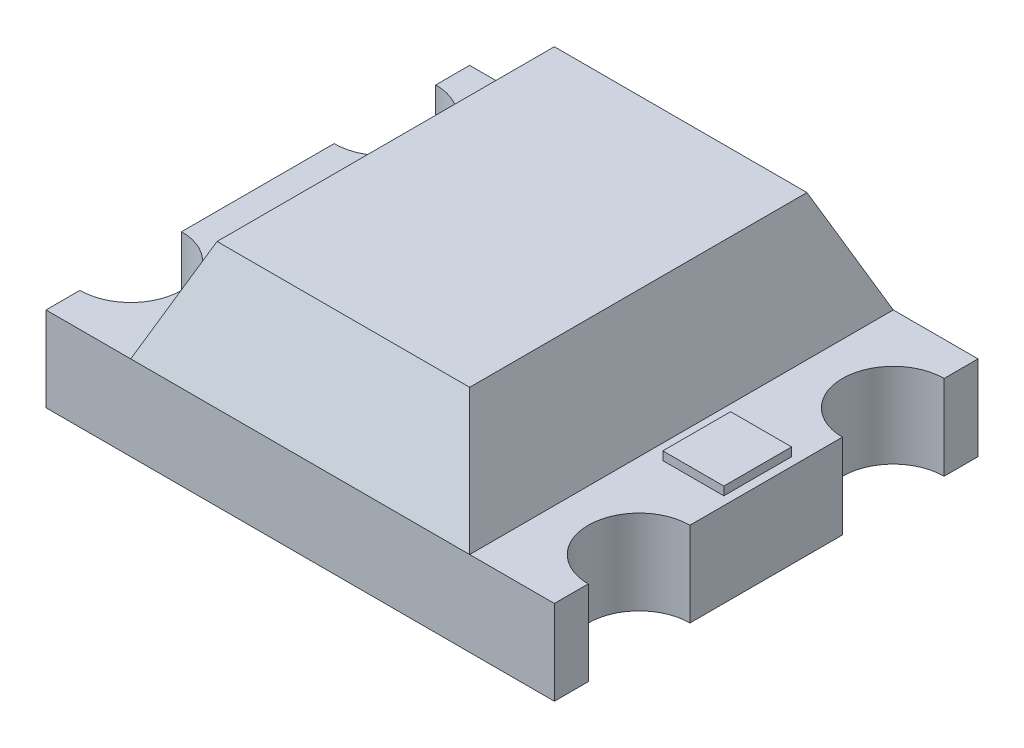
ISO-10303-21;
HEADER;
FILE_DESCRIPTION(('STEP AP214'),'2;1');
FILE_NAME('part.step','',(''),(''),'','','');
FILE_SCHEMA(('AUTOMOTIVE_DESIGN { 1 0 10303 214 1 1 1 1 }'));
ENDSEC;
DATA;
#1=APPLICATION_CONTEXT('core data for automotive mechanical design processes');
#2=APPLICATION_PROTOCOL_DEFINITION('international standard','automotive_design',2000,#1);
#3=PRODUCT_CONTEXT('',#1,'mechanical');
#4=PRODUCT('Part','Part','',(#3));
#5=PRODUCT_RELATED_PRODUCT_CATEGORY('part','',(#4));
#6=PRODUCT_DEFINITION_FORMATION('','',#4);
#7=PRODUCT_DEFINITION_CONTEXT('part definition',#1,'design');
#8=PRODUCT_DEFINITION('design','',#6,#7);
#9=PRODUCT_DEFINITION_SHAPE('','',#8);
#10=(LENGTH_UNIT() NAMED_UNIT(*) SI_UNIT(.MILLI.,.METRE.));
#11=(NAMED_UNIT(*) PLANE_ANGLE_UNIT() SI_UNIT($,.RADIAN.));
#12=(NAMED_UNIT(*) SI_UNIT($,.STERADIAN.) SOLID_ANGLE_UNIT());
#13=UNCERTAINTY_MEASURE_WITH_UNIT(LENGTH_MEASURE(1.E-05),#10,'distance_accuracy_value','');
#14=(GEOMETRIC_REPRESENTATION_CONTEXT(3) GLOBAL_UNCERTAINTY_ASSIGNED_CONTEXT((#13)) GLOBAL_UNIT_ASSIGNED_CONTEXT((#10,
#11,#12)) REPRESENTATION_CONTEXT('',''));
#15=CARTESIAN_POINT('',(0.,0.,0.));
#16=DIRECTION('',(0.,0.,1.));
#17=DIRECTION('',(1.,0.,0.));
#18=AXIS2_PLACEMENT_3D('',#15,#16,#17);
#19=CARTESIAN_POINT('',(-1.,0.5,-1.25));
#20=DIRECTION('',(-0.92050485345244,0.390731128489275,0.));
#21=DIRECTION('',(-0.390731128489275,-0.92050485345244,0.));
#22=AXIS2_PLACEMENT_3D('',#19,#20,#21);
#23=PLANE('',#22);
#24=DIRECTION('',(0.,0.,1.));
#25=VECTOR('',#24,1.);
#26=CARTESIAN_POINT('',(-1.,0.5,-1.25));
#27=LINE('',#26,#25);
#28=CARTESIAN_POINT('',(-1.,0.5,-1.25));
#29=VERTEX_POINT('',#28);
#30=CARTESIAN_POINT('',(-1.,0.5,1.25));
#31=VERTEX_POINT('',#30);
#32=EDGE_CURVE('E96',#29,#31,#27,.T.);
#33=ORIENTED_EDGE('',*,*,#32,.T.);
#34=DIRECTION('',(-0.363936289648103,-0.8573801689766,0.363936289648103));
#35=VECTOR('',#34,1.);
#36=CARTESIAN_POINT('',(-1.,0.5,1.25));
#37=LINE('',#36,#35);
#38=CARTESIAN_POINT('',(-0.745315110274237,1.1,0.995315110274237));
#39=VERTEX_POINT('',#38);
#40=EDGE_CURVE('E12',#39,#31,#37,.T.);
#41=ORIENTED_EDGE('',*,*,#40,.F.);
#42=DIRECTION('',(0.,0.,-1.));
#43=VECTOR('',#42,1.);
#44=CARTESIAN_POINT('',(-0.745315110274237,1.1,-1.25));
#45=LINE('',#44,#43);
#46=CARTESIAN_POINT('',(-0.745315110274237,1.1,-0.995315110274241));
#47=VERTEX_POINT('',#46);
#48=EDGE_CURVE('E118',#47,#39,#45,.F.);
#49=ORIENTED_EDGE('',*,*,#48,.F.);
#50=DIRECTION('',(-0.363936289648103,-0.8573801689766,-0.363936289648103));
#51=VECTOR('',#50,1.);
#52=CARTESIAN_POINT('',(-1.,0.5,-1.25));
#53=LINE('',#52,#51);
#54=EDGE_CURVE('E108',#47,#29,#53,.T.);
#55=ORIENTED_EDGE('',*,*,#54,.T.);
#56=EDGE_LOOP('',(#33,#41,#49,#55));
#57=FACE_BOUND('',#56,.T.);
#58=ADVANCED_FACE('F49',(#57),#23,.T.);
#59=CARTESIAN_POINT('',(-1.,0.5,1.25));
#60=DIRECTION('',(0.,0.390731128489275,0.92050485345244));
#61=DIRECTION('',(0.,-0.92050485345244,0.390731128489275));
#62=AXIS2_PLACEMENT_3D('',#59,#60,#61);
#63=PLANE('',#62);
#64=DIRECTION('',(1.,0.,0.));
#65=VECTOR('',#64,1.);
#66=CARTESIAN_POINT('',(-1.,0.5,1.25));
#67=LINE('',#66,#65);
#68=CARTESIAN_POINT('',(1.,0.5,1.25));
#69=VERTEX_POINT('',#68);
#70=EDGE_CURVE('E92',#31,#69,#67,.T.);
#71=ORIENTED_EDGE('',*,*,#70,.T.);
#72=DIRECTION('',(0.363936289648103,-0.8573801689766,0.363936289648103));
#73=VECTOR('',#72,1.);
#74=CARTESIAN_POINT('',(0.668875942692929,1.28007939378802,0.918875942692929));
#75=LINE('',#74,#73);
#76=CARTESIAN_POINT('',(0.745315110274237,1.1,0.995315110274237));
#77=VERTEX_POINT('',#76);
#78=EDGE_CURVE('E59',#77,#69,#75,.T.);
#79=ORIENTED_EDGE('',*,*,#78,.F.);
#80=DIRECTION('',(-1.,0.,0.));
#81=VECTOR('',#80,1.);
#82=CARTESIAN_POINT('',(-1.,1.1,0.995315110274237));
#83=LINE('',#82,#81);
#84=EDGE_CURVE('E104',#39,#77,#83,.F.);
#85=ORIENTED_EDGE('',*,*,#84,.F.);
#86=ORIENTED_EDGE('',*,*,#40,.T.);
#87=EDGE_LOOP('',(#71,#79,#85,#86));
#88=FACE_BOUND('',#87,.T.);
#89=ADVANCED_FACE('F51',(#88),#63,.T.);
#90=CARTESIAN_POINT('',(1.,0.5,-1.25));
#91=DIRECTION('',(0.92050485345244,0.390731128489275,0.));
#92=DIRECTION('',(-0.390731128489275,0.92050485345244,0.));
#93=AXIS2_PLACEMENT_3D('',#90,#91,#92);
#94=PLANE('',#93);
#95=DIRECTION('',(0.,0.,-1.));
#96=VECTOR('',#95,1.);
#97=CARTESIAN_POINT('',(1.,0.5,-1.25));
#98=LINE('',#97,#96);
#99=CARTESIAN_POINT('',(1.,0.5,-1.25));
#100=VERTEX_POINT('',#99);
#101=EDGE_CURVE('E97',#69,#100,#98,.T.);
#102=ORIENTED_EDGE('',*,*,#101,.T.);
#103=DIRECTION('',(0.363936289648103,-0.8573801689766,-0.363936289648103));
#104=VECTOR('',#103,1.);
#105=CARTESIAN_POINT('',(0.735100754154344,1.12406351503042,-0.985100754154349));
#106=LINE('',#105,#104);
#107=CARTESIAN_POINT('',(0.745315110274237,1.1,-0.995315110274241));
#108=VERTEX_POINT('',#107);
#109=EDGE_CURVE('E121',#108,#100,#106,.T.);
#110=ORIENTED_EDGE('',*,*,#109,.F.);
#111=DIRECTION('',(0.,0.,1.));
#112=VECTOR('',#111,1.);
#113=CARTESIAN_POINT('',(0.745315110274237,1.1,-1.25));
#114=LINE('',#113,#112);
#115=EDGE_CURVE('E71',#77,#108,#114,.F.);
#116=ORIENTED_EDGE('',*,*,#115,.F.);
#117=ORIENTED_EDGE('',*,*,#78,.T.);
#118=EDGE_LOOP('',(#102,#110,#116,#117));
#119=FACE_BOUND('',#118,.T.);
#120=ADVANCED_FACE('F133',(#119),#94,.T.);
#121=CARTESIAN_POINT('',(-1.,0.5,-1.25));
#122=DIRECTION('',(0.,0.390731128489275,-0.92050485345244));
#123=DIRECTION('',(0.,0.92050485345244,0.390731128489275));
#124=AXIS2_PLACEMENT_3D('',#121,#122,#123);
#125=PLANE('',#124);
#126=DIRECTION('',(-1.,0.,0.));
#127=VECTOR('',#126,1.);
#128=CARTESIAN_POINT('',(-1.,0.5,-1.25));
#129=LINE('',#128,#127);
#130=EDGE_CURVE('E116',#100,#29,#129,.T.);
#131=ORIENTED_EDGE('',*,*,#130,.T.);
#132=ORIENTED_EDGE('',*,*,#54,.F.);
#133=DIRECTION('',(1.,0.,0.));
#134=VECTOR('',#133,1.);
#135=CARTESIAN_POINT('',(-1.,1.1,-0.995315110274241));
#136=LINE('',#135,#134);
#137=EDGE_CURVE('E53',#108,#47,#136,.F.);
#138=ORIENTED_EDGE('',*,*,#137,.F.);
#139=ORIENTED_EDGE('',*,*,#109,.T.);
#140=EDGE_LOOP('',(#131,#132,#138,#139));
#141=FACE_BOUND('',#140,.T.);
#142=ADVANCED_FACE('F135',(#141),#125,.T.);
#143=CARTESIAN_POINT('',(-1.,1.1,1.25));
#144=DIRECTION('',(0.,1.,0.));
#145=DIRECTION('',(0.,0.,1.));
#146=AXIS2_PLACEMENT_3D('',#143,#144,#145);
#147=PLANE('',#146);
#148=ORIENTED_EDGE('',*,*,#48,.T.);
#149=ORIENTED_EDGE('',*,*,#84,.T.);
#150=ORIENTED_EDGE('',*,*,#115,.T.);
#151=ORIENTED_EDGE('',*,*,#137,.T.);
#152=EDGE_LOOP('',(#148,#149,#150,#151));
#153=FACE_BOUND('',#152,.T.);
#154=ADVANCED_FACE('F131',(#153),#147,.T.);
#155=CARTESIAN_POINT('',(-1.,0.5,1.25));
#156=DIRECTION('',(0.,1.,0.));
#157=DIRECTION('',(0.,0.,1.));
#158=AXIS2_PLACEMENT_3D('',#155,#156,#157);
#159=PLANE('',#158);
#160=ORIENTED_EDGE('',*,*,#32,.F.);
#161=ORIENTED_EDGE('',*,*,#130,.F.);
#162=ORIENTED_EDGE('',*,*,#101,.F.);
#163=ORIENTED_EDGE('',*,*,#70,.F.);
#164=EDGE_LOOP('',(#160,#161,#162,#163));
#165=FACE_BOUND('',#164,.T.);
#166=ADVANCED_FACE('F93',(#165),#159,.F.);
#167=CLOSED_SHELL('',(#58,#89,#120,#142,#154,#166));
#168=MANIFOLD_SOLID_BREP('B2',#167);
#169=CARTESIAN_POINT('',(-1.5,0.5,0.75));
#170=DIRECTION('',(0.,1.,0.));
#171=DIRECTION('',(0.,0.,1.));
#172=AXIS2_PLACEMENT_3D('',#169,#170,#171);
#173=PLANE('',#172);
#174=DIRECTION('',(1.,0.,0.));
#175=VECTOR('',#174,1.);
#176=CARTESIAN_POINT('',(-0.35,0.5,-0.2));
#177=LINE('',#176,#175);
#178=CARTESIAN_POINT('',(-0.35,0.5,-0.2));
#179=VERTEX_POINT('',#178);
#180=CARTESIAN_POINT('',(0.35,0.5,-0.2));
#181=VERTEX_POINT('',#180);
#182=EDGE_CURVE('E401',#179,#181,#177,.T.);
#183=ORIENTED_EDGE('',*,*,#182,.F.);
#184=DIRECTION('',(0.,0.,1.));
#185=VECTOR('',#184,1.);
#186=CARTESIAN_POINT('',(-0.35,0.5,-0.2));
#187=LINE('',#186,#185);
#188=CARTESIAN_POINT('',(-0.35,0.5,-0.9));
#189=VERTEX_POINT('',#188);
#190=EDGE_CURVE('E386',#189,#179,#187,.T.);
#191=ORIENTED_EDGE('',*,*,#190,.F.);
#192=DIRECTION('',(-1.,0.,0.));
#193=VECTOR('',#192,1.);
#194=CARTESIAN_POINT('',(-0.35,0.5,-0.9));
#195=LINE('',#194,#193);
#196=CARTESIAN_POINT('',(0.35,0.5,-0.9));
#197=VERTEX_POINT('',#196);
#198=EDGE_CURVE('E392',#197,#189,#195,.T.);
#199=ORIENTED_EDGE('',*,*,#198,.F.);
#200=DIRECTION('',(0.,0.,-1.));
#201=VECTOR('',#200,1.);
#202=CARTESIAN_POINT('',(0.35,0.5,-0.2));
#203=LINE('',#202,#201);
#204=EDGE_CURVE('E215',#181,#197,#203,.T.);
#205=ORIENTED_EDGE('',*,*,#204,.F.);
#206=EDGE_LOOP('',(#183,#191,#199,#205));
#207=FACE_BOUND('',#206,.T.);
#208=DIRECTION('',(0.,0.,1.));
#209=VECTOR('',#208,1.);
#210=CARTESIAN_POINT('',(-1.5,0.5,1.25));
#211=LINE('',#210,#209);
#212=CARTESIAN_POINT('',(-1.5,0.5,1.05));
#213=VERTEX_POINT('',#212);
#214=CARTESIAN_POINT('',(-1.5,0.5,1.25));
#215=VERTEX_POINT('',#214);
#216=EDGE_CURVE('E506',#213,#215,#211,.T.);
#217=ORIENTED_EDGE('',*,*,#216,.T.);
#218=DIRECTION('',(1.,0.,0.));
#219=VECTOR('',#218,1.);
#220=CARTESIAN_POINT('',(-1.5,0.5,1.25));
#221=LINE('',#220,#219);
#222=CARTESIAN_POINT('',(1.5,0.5,1.25));
#223=VERTEX_POINT('',#222);
#224=EDGE_CURVE('E510',#215,#223,#221,.T.);
#225=ORIENTED_EDGE('',*,*,#224,.T.);
#226=DIRECTION('',(0.,0.,-1.));
#227=VECTOR('',#226,1.);
#228=CARTESIAN_POINT('',(1.5,0.5,1.25));
#229=LINE('',#228,#227);
#230=CARTESIAN_POINT('',(1.5,0.5,1.05));
#231=VERTEX_POINT('',#230);
#232=EDGE_CURVE('E513',#223,#231,#229,.T.);
#233=ORIENTED_EDGE('',*,*,#232,.T.);
#234=CARTESIAN_POINT('',(1.5,0.5,0.75));
#235=DIRECTION('',(0.,-1.,0.));
#236=DIRECTION('',(0.,0.,-1.));
#237=AXIS2_PLACEMENT_3D('',#234,#235,#236);
#238=CIRCLE('',#237,0.3);
#239=CARTESIAN_POINT('',(1.5,0.5,0.45));
#240=VERTEX_POINT('',#239);
#241=EDGE_CURVE('E516',#231,#240,#238,.T.);
#242=ORIENTED_EDGE('',*,*,#241,.T.);
#243=DIRECTION('',(0.,0.,-1.));
#244=VECTOR('',#243,1.);
#245=CARTESIAN_POINT('',(1.5,0.5,0.45));
#246=LINE('',#245,#244);
#247=CARTESIAN_POINT('',(1.5,0.5,-0.45));
#248=VERTEX_POINT('',#247);
#249=EDGE_CURVE('E519',#240,#248,#246,.T.);
#250=ORIENTED_EDGE('',*,*,#249,.T.);
#251=CARTESIAN_POINT('',(1.5,0.5,-0.75));
#252=DIRECTION('',(0.,-1.,0.));
#253=DIRECTION('',(0.,0.,1.));
#254=AXIS2_PLACEMENT_3D('',#251,#252,#253);
#255=CIRCLE('',#254,0.3);
#256=CARTESIAN_POINT('',(1.5,0.5,-1.05));
#257=VERTEX_POINT('',#256);
#258=EDGE_CURVE('E522',#248,#257,#255,.T.);
#259=ORIENTED_EDGE('',*,*,#258,.T.);
#260=DIRECTION('',(0.,0.,-1.));
#261=VECTOR('',#260,1.);
#262=CARTESIAN_POINT('',(1.5,0.5,-1.05));
#263=LINE('',#262,#261);
#264=CARTESIAN_POINT('',(1.5,0.5,-1.25));
#265=VERTEX_POINT('',#264);
#266=EDGE_CURVE('E525',#257,#265,#263,.T.);
#267=ORIENTED_EDGE('',*,*,#266,.T.);
#268=DIRECTION('',(-1.,0.,0.));
#269=VECTOR('',#268,1.);
#270=CARTESIAN_POINT('',(-1.5,0.5,-1.25));
#271=LINE('',#270,#269);
#272=CARTESIAN_POINT('',(-1.5,0.5,-1.25));
#273=VERTEX_POINT('',#272);
#274=EDGE_CURVE('E528',#265,#273,#271,.T.);
#275=ORIENTED_EDGE('',*,*,#274,.T.);
#276=DIRECTION('',(0.,0.,1.));
#277=VECTOR('',#276,1.);
#278=CARTESIAN_POINT('',(-1.5,0.5,-1.05));
#279=LINE('',#278,#277);
#280=CARTESIAN_POINT('',(-1.5,0.5,-1.05));
#281=VERTEX_POINT('',#280);
#282=EDGE_CURVE('E531',#273,#281,#279,.T.);
#283=ORIENTED_EDGE('',*,*,#282,.T.);
#284=CARTESIAN_POINT('',(-1.5,0.5,-0.75));
#285=DIRECTION('',(0.,-1.,0.));
#286=DIRECTION('',(0.,0.,-1.));
#287=AXIS2_PLACEMENT_3D('',#284,#285,#286);
#288=CIRCLE('',#287,0.3);
#289=CARTESIAN_POINT('',(-1.5,0.5,-0.45));
#290=VERTEX_POINT('',#289);
#291=EDGE_CURVE('E534',#281,#290,#288,.T.);
#292=ORIENTED_EDGE('',*,*,#291,.T.);
#293=DIRECTION('',(0.,0.,1.));
#294=VECTOR('',#293,1.);
#295=CARTESIAN_POINT('',(-1.5,0.5,0.45));
#296=LINE('',#295,#294);
#297=CARTESIAN_POINT('',(-1.5,0.5,0.45));
#298=VERTEX_POINT('',#297);
#299=EDGE_CURVE('E537',#290,#298,#296,.T.);
#300=ORIENTED_EDGE('',*,*,#299,.T.);
#301=CARTESIAN_POINT('',(-1.5,0.5,0.75));
#302=DIRECTION('',(0.,-1.,0.));
#303=DIRECTION('',(0.,0.,1.));
#304=AXIS2_PLACEMENT_3D('',#301,#302,#303);
#305=CIRCLE('',#304,0.3);
#306=EDGE_CURVE('E540',#298,#213,#305,.T.);
#307=ORIENTED_EDGE('',*,*,#306,.T.);
#308=EDGE_LOOP('',(#217,#225,#233,#242,#250,#259,#267,#275,#283,#292,#300,#307));
#309=FACE_BOUND('',#308,.T.);
#310=DIRECTION('',(0.,0.,-1.));
#311=VECTOR('',#310,1.);
#312=CARTESIAN_POINT('',(0.35,0.5,0.9));
#313=LINE('',#312,#311);
#314=CARTESIAN_POINT('',(0.35,0.5,0.9));
#315=VERTEX_POINT('',#314);
#316=CARTESIAN_POINT('',(0.35,0.5,0.2));
#317=VERTEX_POINT('',#316);
#318=EDGE_CURVE('E448',#315,#317,#313,.T.);
#319=ORIENTED_EDGE('',*,*,#318,.F.);
#320=DIRECTION('',(1.,0.,0.));
#321=VECTOR('',#320,1.);
#322=CARTESIAN_POINT('',(-0.35,0.5,0.9));
#323=LINE('',#322,#321);
#324=CARTESIAN_POINT('',(-0.35,0.5,0.9));
#325=VERTEX_POINT('',#324);
#326=EDGE_CURVE('E412',#325,#315,#323,.T.);
#327=ORIENTED_EDGE('',*,*,#326,.F.);
#328=DIRECTION('',(0.,0.,1.));
#329=VECTOR('',#328,1.);
#330=CARTESIAN_POINT('',(-0.35,0.5,0.9));
#331=LINE('',#330,#329);
#332=CARTESIAN_POINT('',(-0.35,0.5,0.2));
#333=VERTEX_POINT('',#332);
#334=EDGE_CURVE('E435',#333,#325,#331,.T.);
#335=ORIENTED_EDGE('',*,*,#334,.F.);
#336=DIRECTION('',(-1.,0.,0.));
#337=VECTOR('',#336,1.);
#338=CARTESIAN_POINT('',(-0.35,0.5,0.2));
#339=LINE('',#338,#337);
#340=EDGE_CURVE('E451',#317,#333,#339,.T.);
#341=ORIENTED_EDGE('',*,*,#340,.F.);
#342=EDGE_LOOP('',(#319,#327,#335,#341));
#343=FACE_BOUND('',#342,.T.);
#344=DIRECTION('',(-1.,0.,0.));
#345=VECTOR('',#344,1.);
#346=CARTESIAN_POINT('',(1.45,0.5,-0.2));
#347=LINE('',#346,#345);
#348=CARTESIAN_POINT('',(1.45,0.5,-0.2));
#349=VERTEX_POINT('',#348);
#350=CARTESIAN_POINT('',(1.09,0.5,-0.2));
#351=VERTEX_POINT('',#350);
#352=EDGE_CURVE('E947',#349,#351,#347,.T.);
#353=ORIENTED_EDGE('',*,*,#352,.F.);
#354=DIRECTION('',(0.,0.,-1.));
#355=VECTOR('',#354,1.);
#356=CARTESIAN_POINT('',(1.45,0.5,-0.2));
#357=LINE('',#356,#355);
#358=CARTESIAN_POINT('',(1.45,0.5,0.2));
#359=VERTEX_POINT('',#358);
#360=EDGE_CURVE('E378',#359,#349,#357,.T.);
#361=ORIENTED_EDGE('',*,*,#360,.F.);
#362=DIRECTION('',(1.,0.,0.));
#363=VECTOR('',#362,1.);
#364=CARTESIAN_POINT('',(1.45,0.5,0.2));
#365=LINE('',#364,#363);
#366=CARTESIAN_POINT('',(1.09,0.5,0.2));
#367=VERTEX_POINT('',#366);
#368=EDGE_CURVE('E374',#367,#359,#365,.T.);
#369=ORIENTED_EDGE('',*,*,#368,.F.);
#370=DIRECTION('',(0.,0.,1.));
#371=VECTOR('',#370,1.);
#372=CARTESIAN_POINT('',(1.09,0.5,-0.2));
#373=LINE('',#372,#371);
#374=EDGE_CURVE('E943',#351,#367,#373,.T.);
#375=ORIENTED_EDGE('',*,*,#374,.F.);
#376=EDGE_LOOP('',(#353,#361,#369,#375));
#377=FACE_BOUND('',#376,.T.);
#378=ADVANCED_FACE('F191',(#207,#309,#343,#377),#173,.T.);
#379=CARTESIAN_POINT('',(-1.5,0.5,1.25));
#380=DIRECTION('',(1.,0.,0.));
#381=DIRECTION('',(0.,0.,-1.));
#382=AXIS2_PLACEMENT_3D('',#379,#380,#381);
#383=PLANE('',#382);
#384=DIRECTION('',(0.,0.,1.));
#385=VECTOR('',#384,1.);
#386=CARTESIAN_POINT('',(-1.5,0.,1.25));
#387=LINE('',#386,#385);
#388=CARTESIAN_POINT('',(-1.5,0.,1.05));
#389=VERTEX_POINT('',#388);
#390=CARTESIAN_POINT('',(-1.5,0.,1.25));
#391=VERTEX_POINT('',#390);
#392=EDGE_CURVE('E469',#389,#391,#387,.T.);
#393=ORIENTED_EDGE('',*,*,#392,.T.);
#394=DIRECTION('',(0.,-1.,0.));
#395=VECTOR('',#394,1.);
#396=CARTESIAN_POINT('',(-1.5,0.5,1.25));
#397=LINE('',#396,#395);
#398=EDGE_CURVE('E47',#215,#391,#397,.T.);
#399=ORIENTED_EDGE('',*,*,#398,.F.);
#400=ORIENTED_EDGE('',*,*,#216,.F.);
#401=DIRECTION('',(0.,-1.,0.));
#402=VECTOR('',#401,1.);
#403=CARTESIAN_POINT('',(-1.5,0.5,1.05));
#404=LINE('',#403,#402);
#405=EDGE_CURVE('E543',#213,#389,#404,.T.);
#406=ORIENTED_EDGE('',*,*,#405,.T.);
#407=EDGE_LOOP('',(#393,#399,#400,#406));
#408=FACE_BOUND('',#407,.T.);
#409=ADVANCED_FACE('F193',(#408),#383,.F.);
#410=CARTESIAN_POINT('',(-1.5,0.5,1.25));
#411=DIRECTION('',(0.,0.,-1.));
#412=DIRECTION('',(-1.,0.,0.));
#413=AXIS2_PLACEMENT_3D('',#410,#411,#412);
#414=PLANE('',#413);
#415=DIRECTION('',(1.,0.,0.));
#416=VECTOR('',#415,1.);
#417=CARTESIAN_POINT('',(-1.5,0.,1.25));
#418=LINE('',#417,#416);
#419=CARTESIAN_POINT('',(1.5,0.,1.25));
#420=VERTEX_POINT('',#419);
#421=EDGE_CURVE('E473',#391,#420,#418,.T.);
#422=ORIENTED_EDGE('',*,*,#421,.T.);
#423=DIRECTION('',(0.,-1.,0.));
#424=VECTOR('',#423,1.);
#425=CARTESIAN_POINT('',(1.5,0.5,1.25));
#426=LINE('',#425,#424);
#427=EDGE_CURVE('E200',#223,#420,#426,.T.);
#428=ORIENTED_EDGE('',*,*,#427,.F.);
#429=ORIENTED_EDGE('',*,*,#224,.F.);
#430=ORIENTED_EDGE('',*,*,#398,.T.);
#431=EDGE_LOOP('',(#422,#428,#429,#430));
#432=FACE_BOUND('',#431,.T.);
#433=ADVANCED_FACE('F611',(#432),#414,.F.);
#434=CARTESIAN_POINT('',(1.5,0.5,1.25));
#435=DIRECTION('',(-1.,0.,0.));
#436=DIRECTION('',(0.,0.,1.));
#437=AXIS2_PLACEMENT_3D('',#434,#435,#436);
#438=PLANE('',#437);
#439=DIRECTION('',(0.,0.,-1.));
#440=VECTOR('',#439,1.);
#441=CARTESIAN_POINT('',(1.5,0.,1.25));
#442=LINE('',#441,#440);
#443=CARTESIAN_POINT('',(1.5,0.,1.05));
#444=VERTEX_POINT('',#443);
#445=EDGE_CURVE('E476',#420,#444,#442,.T.);
#446=ORIENTED_EDGE('',*,*,#445,.T.);
#447=DIRECTION('',(0.,-1.,0.));
#448=VECTOR('',#447,1.);
#449=CARTESIAN_POINT('',(1.5,0.5,1.05));
#450=LINE('',#449,#448);
#451=EDGE_CURVE('E579',#231,#444,#450,.T.);
#452=ORIENTED_EDGE('',*,*,#451,.F.);
#453=ORIENTED_EDGE('',*,*,#232,.F.);
#454=ORIENTED_EDGE('',*,*,#427,.T.);
#455=EDGE_LOOP('',(#446,#452,#453,#454));
#456=FACE_BOUND('',#455,.T.);
#457=ADVANCED_FACE('F588',(#456),#438,.F.);
#458=CARTESIAN_POINT('',(1.5,0.5,0.75));
#459=DIRECTION('',(0.,-1.,0.));
#460=DIRECTION('',(0.,0.,-1.));
#461=AXIS2_PLACEMENT_3D('',#458,#459,#460);
#462=CYLINDRICAL_SURFACE('',#461,0.3);
#463=CARTESIAN_POINT('',(1.5,0.,0.75));
#464=DIRECTION('',(0.,-1.,0.));
#465=DIRECTION('',(0.,0.,-1.));
#466=AXIS2_PLACEMENT_3D('',#463,#464,#465);
#467=CIRCLE('',#466,0.3);
#468=CARTESIAN_POINT('',(1.5,0.,0.45));
#469=VERTEX_POINT('',#468);
#470=EDGE_CURVE('E479',#444,#469,#467,.T.);
#471=ORIENTED_EDGE('',*,*,#470,.T.);
#472=DIRECTION('',(0.,-1.,0.));
#473=VECTOR('',#472,1.);
#474=CARTESIAN_POINT('',(1.5,0.5,0.45));
#475=LINE('',#474,#473);
#476=EDGE_CURVE('E575',#240,#469,#475,.T.);
#477=ORIENTED_EDGE('',*,*,#476,.F.);
#478=ORIENTED_EDGE('',*,*,#241,.F.);
#479=ORIENTED_EDGE('',*,*,#451,.T.);
#480=EDGE_LOOP('',(#471,#477,#478,#479));
#481=FACE_BOUND('',#480,.T.);
#482=ADVANCED_FACE('F599',(#481),#462,.F.);
#483=CARTESIAN_POINT('',(1.5,0.5,0.45));
#484=DIRECTION('',(-1.,0.,0.));
#485=DIRECTION('',(0.,0.,1.));
#486=AXIS2_PLACEMENT_3D('',#483,#484,#485);
#487=PLANE('',#486);
#488=DIRECTION('',(0.,0.,-1.));
#489=VECTOR('',#488,1.);
#490=CARTESIAN_POINT('',(1.5,0.,0.45));
#491=LINE('',#490,#489);
#492=CARTESIAN_POINT('',(1.5,0.,-0.45));
#493=VERTEX_POINT('',#492);
#494=EDGE_CURVE('E482',#469,#493,#491,.T.);
#495=ORIENTED_EDGE('',*,*,#494,.T.);
#496=DIRECTION('',(0.,-1.,0.));
#497=VECTOR('',#496,1.);
#498=CARTESIAN_POINT('',(1.5,0.5,-0.45));
#499=LINE('',#498,#497);
#500=EDGE_CURVE('E571',#248,#493,#499,.T.);
#501=ORIENTED_EDGE('',*,*,#500,.F.);
#502=ORIENTED_EDGE('',*,*,#249,.F.);
#503=ORIENTED_EDGE('',*,*,#476,.T.);
#504=EDGE_LOOP('',(#495,#501,#502,#503));
#505=FACE_BOUND('',#504,.T.);
#506=ADVANCED_FACE('F603',(#505),#487,.F.);
#507=CARTESIAN_POINT('',(1.5,0.5,-0.75));
#508=DIRECTION('',(0.,-1.,0.));
#509=DIRECTION('',(0.,0.,-1.));
#510=AXIS2_PLACEMENT_3D('',#507,#508,#509);
#511=CYLINDRICAL_SURFACE('',#510,0.3);
#512=CARTESIAN_POINT('',(1.5,0.,-0.75));
#513=DIRECTION('',(0.,-1.,0.));
#514=DIRECTION('',(0.,0.,1.));
#515=AXIS2_PLACEMENT_3D('',#512,#513,#514);
#516=CIRCLE('',#515,0.3);
#517=CARTESIAN_POINT('',(1.5,0.,-1.05));
#518=VERTEX_POINT('',#517);
#519=EDGE_CURVE('E485',#493,#518,#516,.T.);
#520=ORIENTED_EDGE('',*,*,#519,.T.);
#521=DIRECTION('',(0.,-1.,0.));
#522=VECTOR('',#521,1.);
#523=CARTESIAN_POINT('',(1.5,0.5,-1.05));
#524=LINE('',#523,#522);
#525=EDGE_CURVE('E567',#257,#518,#524,.T.);
#526=ORIENTED_EDGE('',*,*,#525,.F.);
#527=ORIENTED_EDGE('',*,*,#258,.F.);
#528=ORIENTED_EDGE('',*,*,#500,.T.);
#529=EDGE_LOOP('',(#520,#526,#527,#528));
#530=FACE_BOUND('',#529,.T.);
#531=ADVANCED_FACE('F644',(#530),#511,.F.);
#532=CARTESIAN_POINT('',(1.5,0.5,-1.05));
#533=DIRECTION('',(-1.,0.,0.));
#534=DIRECTION('',(0.,0.,1.));
#535=AXIS2_PLACEMENT_3D('',#532,#533,#534);
#536=PLANE('',#535);
#537=DIRECTION('',(0.,0.,-1.));
#538=VECTOR('',#537,1.);
#539=CARTESIAN_POINT('',(1.5,0.,-1.05));
#540=LINE('',#539,#538);
#541=CARTESIAN_POINT('',(1.5,0.,-1.25));
#542=VERTEX_POINT('',#541);
#543=EDGE_CURVE('E488',#518,#542,#540,.T.);
#544=ORIENTED_EDGE('',*,*,#543,.T.);
#545=DIRECTION('',(0.,-1.,0.));
#546=VECTOR('',#545,1.);
#547=CARTESIAN_POINT('',(1.5,0.5,-1.25));
#548=LINE('',#547,#546);
#549=EDGE_CURVE('E563',#265,#542,#548,.T.);
#550=ORIENTED_EDGE('',*,*,#549,.F.);
#551=ORIENTED_EDGE('',*,*,#266,.F.);
#552=ORIENTED_EDGE('',*,*,#525,.T.);
#553=EDGE_LOOP('',(#544,#550,#551,#552));
#554=FACE_BOUND('',#553,.T.);
#555=ADVANCED_FACE('F642',(#554),#536,.F.);
#556=CARTESIAN_POINT('',(-1.5,0.5,-1.25));
#557=DIRECTION('',(0.,0.,1.));
#558=DIRECTION('',(1.,0.,0.));
#559=AXIS2_PLACEMENT_3D('',#556,#557,#558);
#560=PLANE('',#559);
#561=DIRECTION('',(-1.,0.,0.));
#562=VECTOR('',#561,1.);
#563=CARTESIAN_POINT('',(-1.5,0.,-1.25));
#564=LINE('',#563,#562);
#565=CARTESIAN_POINT('',(-1.5,0.,-1.25));
#566=VERTEX_POINT('',#565);
#567=EDGE_CURVE('E491',#542,#566,#564,.T.);
#568=ORIENTED_EDGE('',*,*,#567,.T.);
#569=DIRECTION('',(0.,-1.,0.));
#570=VECTOR('',#569,1.);
#571=CARTESIAN_POINT('',(-1.5,0.5,-1.25));
#572=LINE('',#571,#570);
#573=EDGE_CURVE('E559',#273,#566,#572,.T.);
#574=ORIENTED_EDGE('',*,*,#573,.F.);
#575=ORIENTED_EDGE('',*,*,#274,.F.);
#576=ORIENTED_EDGE('',*,*,#549,.T.);
#577=EDGE_LOOP('',(#568,#574,#575,#576));
#578=FACE_BOUND('',#577,.T.);
#579=ADVANCED_FACE('F638',(#578),#560,.F.);
#580=CARTESIAN_POINT('',(-1.5,0.5,-1.05));
#581=DIRECTION('',(1.,0.,0.));
#582=DIRECTION('',(0.,0.,-1.));
#583=AXIS2_PLACEMENT_3D('',#580,#581,#582);
#584=PLANE('',#583);
#585=DIRECTION('',(0.,0.,1.));
#586=VECTOR('',#585,1.);
#587=CARTESIAN_POINT('',(-1.5,0.,-1.05));
#588=LINE('',#587,#586);
#589=CARTESIAN_POINT('',(-1.5,0.,-1.05));
#590=VERTEX_POINT('',#589);
#591=EDGE_CURVE('E494',#566,#590,#588,.T.);
#592=ORIENTED_EDGE('',*,*,#591,.T.);
#593=DIRECTION('',(0.,-1.,0.));
#594=VECTOR('',#593,1.);
#595=CARTESIAN_POINT('',(-1.5,0.5,-1.05));
#596=LINE('',#595,#594);
#597=EDGE_CURVE('E555',#281,#590,#596,.T.);
#598=ORIENTED_EDGE('',*,*,#597,.F.);
#599=ORIENTED_EDGE('',*,*,#282,.F.);
#600=ORIENTED_EDGE('',*,*,#573,.T.);
#601=EDGE_LOOP('',(#592,#598,#599,#600));
#602=FACE_BOUND('',#601,.T.);
#603=ADVANCED_FACE('F633',(#602),#584,.F.);
#604=CARTESIAN_POINT('',(-1.5,0.5,-0.75));
#605=DIRECTION('',(0.,-1.,0.));
#606=DIRECTION('',(0.,0.,-1.));
#607=AXIS2_PLACEMENT_3D('',#604,#605,#606);
#608=CYLINDRICAL_SURFACE('',#607,0.3);
#609=CARTESIAN_POINT('',(-1.5,0.,-0.75));
#610=DIRECTION('',(0.,-1.,0.));
#611=DIRECTION('',(0.,0.,-1.));
#612=AXIS2_PLACEMENT_3D('',#609,#610,#611);
#613=CIRCLE('',#612,0.3);
#614=CARTESIAN_POINT('',(-1.5,0.,-0.45));
#615=VERTEX_POINT('',#614);
#616=EDGE_CURVE('E497',#590,#615,#613,.T.);
#617=ORIENTED_EDGE('',*,*,#616,.T.);
#618=DIRECTION('',(0.,-1.,0.));
#619=VECTOR('',#618,1.);
#620=CARTESIAN_POINT('',(-1.5,0.5,-0.45));
#621=LINE('',#620,#619);
#622=EDGE_CURVE('E551',#290,#615,#621,.T.);
#623=ORIENTED_EDGE('',*,*,#622,.F.);
#624=ORIENTED_EDGE('',*,*,#291,.F.);
#625=ORIENTED_EDGE('',*,*,#597,.T.);
#626=EDGE_LOOP('',(#617,#623,#624,#625));
#627=FACE_BOUND('',#626,.T.);
#628=ADVANCED_FACE('F627',(#627),#608,.F.);
#629=CARTESIAN_POINT('',(-1.5,0.5,0.45));
#630=DIRECTION('',(1.,0.,0.));
#631=DIRECTION('',(0.,0.,-1.));
#632=AXIS2_PLACEMENT_3D('',#629,#630,#631);
#633=PLANE('',#632);
#634=DIRECTION('',(0.,0.,1.));
#635=VECTOR('',#634,1.);
#636=CARTESIAN_POINT('',(-1.5,0.,0.45));
#637=LINE('',#636,#635);
#638=CARTESIAN_POINT('',(-1.5,0.,0.45));
#639=VERTEX_POINT('',#638);
#640=EDGE_CURVE('E500',#615,#639,#637,.T.);
#641=ORIENTED_EDGE('',*,*,#640,.T.);
#642=DIRECTION('',(0.,-1.,0.));
#643=VECTOR('',#642,1.);
#644=CARTESIAN_POINT('',(-1.5,0.5,0.45));
#645=LINE('',#644,#643);
#646=EDGE_CURVE('E547',#298,#639,#645,.T.);
#647=ORIENTED_EDGE('',*,*,#646,.F.);
#648=ORIENTED_EDGE('',*,*,#299,.F.);
#649=ORIENTED_EDGE('',*,*,#622,.T.);
#650=EDGE_LOOP('',(#641,#647,#648,#649));
#651=FACE_BOUND('',#650,.T.);
#652=ADVANCED_FACE('F623',(#651),#633,.F.);
#653=CARTESIAN_POINT('',(-1.5,0.5,0.75));
#654=DIRECTION('',(0.,-1.,0.));
#655=DIRECTION('',(0.,0.,-1.));
#656=AXIS2_PLACEMENT_3D('',#653,#654,#655);
#657=CYLINDRICAL_SURFACE('',#656,0.3);
#658=CARTESIAN_POINT('',(-1.5,0.,0.75));
#659=DIRECTION('',(0.,-1.,0.));
#660=DIRECTION('',(0.,0.,1.));
#661=AXIS2_PLACEMENT_3D('',#658,#659,#660);
#662=CIRCLE('',#661,0.3);
#663=EDGE_CURVE('E503',#639,#389,#662,.T.);
#664=ORIENTED_EDGE('',*,*,#663,.T.);
#665=ORIENTED_EDGE('',*,*,#405,.F.);
#666=ORIENTED_EDGE('',*,*,#306,.F.);
#667=ORIENTED_EDGE('',*,*,#646,.T.);
#668=EDGE_LOOP('',(#664,#665,#666,#667));
#669=FACE_BOUND('',#668,.T.);
#670=ADVANCED_FACE('F618',(#669),#657,.F.);
#671=CARTESIAN_POINT('',(-1.5,0.,0.75));
#672=DIRECTION('',(0.,1.,0.));
#673=DIRECTION('',(0.,0.,1.));
#674=AXIS2_PLACEMENT_3D('',#671,#672,#673);
#675=PLANE('',#674);
#676=ORIENTED_EDGE('',*,*,#392,.F.);
#677=ORIENTED_EDGE('',*,*,#663,.F.);
#678=ORIENTED_EDGE('',*,*,#640,.F.);
#679=ORIENTED_EDGE('',*,*,#616,.F.);
#680=ORIENTED_EDGE('',*,*,#591,.F.);
#681=ORIENTED_EDGE('',*,*,#567,.F.);
#682=ORIENTED_EDGE('',*,*,#543,.F.);
#683=ORIENTED_EDGE('',*,*,#519,.F.);
#684=ORIENTED_EDGE('',*,*,#494,.F.);
#685=ORIENTED_EDGE('',*,*,#470,.F.);
#686=ORIENTED_EDGE('',*,*,#445,.F.);
#687=ORIENTED_EDGE('',*,*,#421,.F.);
#688=EDGE_LOOP('',(#676,#677,#678,#679,#680,#681,#682,#683,#684,#685,#686,#687));
#689=FACE_BOUND('',#688,.T.);
#690=ADVANCED_FACE('F594',(#689),#675,.F.);
#691=CARTESIAN_POINT('',(-0.35,0.7,0.9));
#692=DIRECTION('',(0.,0.,-1.));
#693=DIRECTION('',(-1.,0.,0.));
#694=AXIS2_PLACEMENT_3D('',#691,#692,#693);
#695=PLANE('',#694);
#696=ORIENTED_EDGE('',*,*,#326,.T.);
#697=DIRECTION('',(0.,-1.,0.));
#698=VECTOR('',#697,1.);
#699=CARTESIAN_POINT('',(0.35,0.7,0.9));
#700=LINE('',#699,#698);
#701=CARTESIAN_POINT('',(0.35,0.7,0.9));
#702=VERTEX_POINT('',#701);
#703=EDGE_CURVE('E466',#702,#315,#700,.T.);
#704=ORIENTED_EDGE('',*,*,#703,.F.);
#705=DIRECTION('',(1.,0.,0.));
#706=VECTOR('',#705,1.);
#707=CARTESIAN_POINT('',(-0.35,0.7,0.9));
#708=LINE('',#707,#706);
#709=CARTESIAN_POINT('',(-0.35,0.7,0.9));
#710=VERTEX_POINT('',#709);
#711=EDGE_CURVE('E430',#710,#702,#708,.T.);
#712=ORIENTED_EDGE('',*,*,#711,.F.);
#713=DIRECTION('',(0.,-1.,0.));
#714=VECTOR('',#713,1.);
#715=CARTESIAN_POINT('',(-0.35,0.7,0.9));
#716=LINE('',#715,#714);
#717=EDGE_CURVE('E444',#710,#325,#716,.T.);
#718=ORIENTED_EDGE('',*,*,#717,.T.);
#719=EDGE_LOOP('',(#696,#704,#712,#718));
#720=FACE_BOUND('',#719,.T.);
#721=ADVANCED_FACE('F693',(#720),#695,.F.);
#722=CARTESIAN_POINT('',(0.35,0.7,0.9));
#723=DIRECTION('',(-1.,0.,0.));
#724=DIRECTION('',(0.,0.,1.));
#725=AXIS2_PLACEMENT_3D('',#722,#723,#724);
#726=PLANE('',#725);
#727=ORIENTED_EDGE('',*,*,#318,.T.);
#728=DIRECTION('',(0.,-1.,0.));
#729=VECTOR('',#728,1.);
#730=CARTESIAN_POINT('',(0.35,0.7,0.2));
#731=LINE('',#730,#729);
#732=CARTESIAN_POINT('',(0.35,0.7,0.2));
#733=VERTEX_POINT('',#732);
#734=EDGE_CURVE('E462',#733,#317,#731,.T.);
#735=ORIENTED_EDGE('',*,*,#734,.F.);
#736=DIRECTION('',(0.,0.,-1.));
#737=VECTOR('',#736,1.);
#738=CARTESIAN_POINT('',(0.35,0.7,0.9));
#739=LINE('',#738,#737);
#740=EDGE_CURVE('E434',#702,#733,#739,.T.);
#741=ORIENTED_EDGE('',*,*,#740,.F.);
#742=ORIENTED_EDGE('',*,*,#703,.T.);
#743=EDGE_LOOP('',(#727,#735,#741,#742));
#744=FACE_BOUND('',#743,.T.);
#745=ADVANCED_FACE('F698',(#744),#726,.F.);
#746=CARTESIAN_POINT('',(-0.35,0.7,0.2));
#747=DIRECTION('',(0.,0.,1.));
#748=DIRECTION('',(1.,0.,0.));
#749=AXIS2_PLACEMENT_3D('',#746,#747,#748);
#750=PLANE('',#749);
#751=ORIENTED_EDGE('',*,*,#340,.T.);
#752=DIRECTION('',(0.,-1.,0.));
#753=VECTOR('',#752,1.);
#754=CARTESIAN_POINT('',(-0.35,0.7,0.2));
#755=LINE('',#754,#753);
#756=CARTESIAN_POINT('',(-0.35,0.7,0.2));
#757=VERTEX_POINT('',#756);
#758=EDGE_CURVE('E460',#757,#333,#755,.T.);
#759=ORIENTED_EDGE('',*,*,#758,.F.);
#760=DIRECTION('',(-1.,0.,0.));
#761=VECTOR('',#760,1.);
#762=CARTESIAN_POINT('',(-0.35,0.7,0.2));
#763=LINE('',#762,#761);
#764=EDGE_CURVE('E438',#733,#757,#763,.T.);
#765=ORIENTED_EDGE('',*,*,#764,.F.);
#766=ORIENTED_EDGE('',*,*,#734,.T.);
#767=EDGE_LOOP('',(#751,#759,#765,#766));
#768=FACE_BOUND('',#767,.T.);
#769=ADVANCED_FACE('F704',(#768),#750,.F.);
#770=CARTESIAN_POINT('',(-0.35,0.7,0.9));
#771=DIRECTION('',(1.,0.,0.));
#772=DIRECTION('',(0.,0.,-1.));
#773=AXIS2_PLACEMENT_3D('',#770,#771,#772);
#774=PLANE('',#773);
#775=ORIENTED_EDGE('',*,*,#334,.T.);
#776=ORIENTED_EDGE('',*,*,#717,.F.);
#777=DIRECTION('',(0.,0.,1.));
#778=VECTOR('',#777,1.);
#779=CARTESIAN_POINT('',(-0.35,0.7,0.9));
#780=LINE('',#779,#778);
#781=EDGE_CURVE('E441',#757,#710,#780,.T.);
#782=ORIENTED_EDGE('',*,*,#781,.F.);
#783=ORIENTED_EDGE('',*,*,#758,.T.);
#784=EDGE_LOOP('',(#775,#776,#782,#783));
#785=FACE_BOUND('',#784,.T.);
#786=ADVANCED_FACE('F711',(#785),#774,.F.);
#787=CARTESIAN_POINT('',(0.35,0.7,0.9));
#788=DIRECTION('',(0.,1.,0.));
#789=DIRECTION('',(0.,0.,1.));
#790=AXIS2_PLACEMENT_3D('',#787,#788,#789);
#791=PLANE('',#790);
#792=ORIENTED_EDGE('',*,*,#711,.T.);
#793=ORIENTED_EDGE('',*,*,#740,.T.);
#794=ORIENTED_EDGE('',*,*,#764,.T.);
#795=ORIENTED_EDGE('',*,*,#781,.T.);
#796=EDGE_LOOP('',(#792,#793,#794,#795));
#797=FACE_BOUND('',#796,.T.);
#798=ADVANCED_FACE('F718',(#797),#791,.T.);
#799=CARTESIAN_POINT('',(-0.35,1.68994949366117,-0.2));
#800=DIRECTION('',(1.,0.,0.));
#801=DIRECTION('',(0.,0.,-1.));
#802=AXIS2_PLACEMENT_3D('',#799,#800,#801);
#803=PLANE('',#802);
#804=DIRECTION('',(0.,0.,1.));
#805=VECTOR('',#804,1.);
#806=CARTESIAN_POINT('',(-0.35,0.7,-0.2));
#807=LINE('',#806,#805);
#808=CARTESIAN_POINT('',(-0.35,0.7,-0.9));
#809=VERTEX_POINT('',#808);
#810=CARTESIAN_POINT('',(-0.35,0.7,-0.2));
#811=VERTEX_POINT('',#810);
#812=EDGE_CURVE('E417',#809,#811,#807,.T.);
#813=ORIENTED_EDGE('',*,*,#812,.F.);
#814=DIRECTION('',(0.,-1.,0.));
#815=VECTOR('',#814,1.);
#816=CARTESIAN_POINT('',(-0.35,1.68994949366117,-0.9));
#817=LINE('',#816,#815);
#818=EDGE_CURVE('E381',#809,#189,#817,.T.);
#819=ORIENTED_EDGE('',*,*,#818,.T.);
#820=ORIENTED_EDGE('',*,*,#190,.T.);
#821=DIRECTION('',(0.,-1.,0.));
#822=VECTOR('',#821,1.);
#823=CARTESIAN_POINT('',(-0.35,1.68994949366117,-0.2));
#824=LINE('',#823,#822);
#825=EDGE_CURVE('E405',#811,#179,#824,.T.);
#826=ORIENTED_EDGE('',*,*,#825,.F.);
#827=EDGE_LOOP('',(#813,#819,#820,#826));
#828=FACE_BOUND('',#827,.T.);
#829=ADVANCED_FACE('F725',(#828),#803,.F.);
#830=CARTESIAN_POINT('',(-0.35,1.68994949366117,-0.2));
#831=DIRECTION('',(0.,0.,-1.));
#832=DIRECTION('',(-1.,0.,0.));
#833=AXIS2_PLACEMENT_3D('',#830,#831,#832);
#834=PLANE('',#833);
#835=DIRECTION('',(1.,0.,0.));
#836=VECTOR('',#835,1.);
#837=CARTESIAN_POINT('',(-0.35,0.7,-0.2));
#838=LINE('',#837,#836);
#839=CARTESIAN_POINT('',(0.35,0.7,-0.2));
#840=VERTEX_POINT('',#839);
#841=EDGE_CURVE('E413',#811,#840,#838,.T.);
#842=ORIENTED_EDGE('',*,*,#841,.F.);
#843=ORIENTED_EDGE('',*,*,#825,.T.);
#844=ORIENTED_EDGE('',*,*,#182,.T.);
#845=DIRECTION('',(0.,-1.,0.));
#846=VECTOR('',#845,1.);
#847=CARTESIAN_POINT('',(0.35,1.68994949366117,-0.2));
#848=LINE('',#847,#846);
#849=EDGE_CURVE('E400',#840,#181,#848,.T.);
#850=ORIENTED_EDGE('',*,*,#849,.F.);
#851=EDGE_LOOP('',(#842,#843,#844,#850));
#852=FACE_BOUND('',#851,.T.);
#853=ADVANCED_FACE('F732',(#852),#834,.F.);
#854=CARTESIAN_POINT('',(0.35,1.68994949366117,-0.2));
#855=DIRECTION('',(-1.,0.,0.));
#856=DIRECTION('',(0.,0.,1.));
#857=AXIS2_PLACEMENT_3D('',#854,#855,#856);
#858=PLANE('',#857);
#859=DIRECTION('',(0.,0.,-1.));
#860=VECTOR('',#859,1.);
#861=CARTESIAN_POINT('',(0.35,0.7,-0.2));
#862=LINE('',#861,#860);
#863=CARTESIAN_POINT('',(0.35,0.7,-0.9));
#864=VERTEX_POINT('',#863);
#865=EDGE_CURVE('E408',#840,#864,#862,.T.);
#866=ORIENTED_EDGE('',*,*,#865,.F.);
#867=ORIENTED_EDGE('',*,*,#849,.T.);
#868=ORIENTED_EDGE('',*,*,#204,.T.);
#869=DIRECTION('',(0.,-1.,0.));
#870=VECTOR('',#869,1.);
#871=CARTESIAN_POINT('',(0.35,1.68994949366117,-0.9));
#872=LINE('',#871,#870);
#873=EDGE_CURVE('E397',#864,#197,#872,.T.);
#874=ORIENTED_EDGE('',*,*,#873,.F.);
#875=EDGE_LOOP('',(#866,#867,#868,#874));
#876=FACE_BOUND('',#875,.T.);
#877=ADVANCED_FACE('F739',(#876),#858,.F.);
#878=CARTESIAN_POINT('',(-0.35,1.68994949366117,-0.9));
#879=DIRECTION('',(0.,0.,1.));
#880=DIRECTION('',(1.,0.,0.));
#881=AXIS2_PLACEMENT_3D('',#878,#879,#880);
#882=PLANE('',#881);
#883=DIRECTION('',(-1.,0.,0.));
#884=VECTOR('',#883,1.);
#885=CARTESIAN_POINT('',(-0.35,0.7,-0.9));
#886=LINE('',#885,#884);
#887=EDGE_CURVE('E396',#864,#809,#886,.T.);
#888=ORIENTED_EDGE('',*,*,#887,.F.);
#889=ORIENTED_EDGE('',*,*,#873,.T.);
#890=ORIENTED_EDGE('',*,*,#198,.T.);
#891=ORIENTED_EDGE('',*,*,#818,.F.);
#892=EDGE_LOOP('',(#888,#889,#890,#891));
#893=FACE_BOUND('',#892,.T.);
#894=ADVANCED_FACE('F746',(#893),#882,.F.);
#895=CARTESIAN_POINT('',(0.35,0.7,0.9));
#896=DIRECTION('',(0.,1.,0.));
#897=DIRECTION('',(0.,0.,1.));
#898=AXIS2_PLACEMENT_3D('',#895,#896,#897);
#899=PLANE('',#898);
#900=ORIENTED_EDGE('',*,*,#887,.T.);
#901=ORIENTED_EDGE('',*,*,#812,.T.);
#902=ORIENTED_EDGE('',*,*,#841,.T.);
#903=ORIENTED_EDGE('',*,*,#865,.T.);
#904=EDGE_LOOP('',(#900,#901,#902,#903));
#905=FACE_BOUND('',#904,.T.);
#906=ADVANCED_FACE('F752',(#905),#899,.T.);
#907=CARTESIAN_POINT('',(1.45,0.55,-0.2));
#908=DIRECTION('',(-1.,0.,0.));
#909=DIRECTION('',(0.,0.,1.));
#910=AXIS2_PLACEMENT_3D('',#907,#908,#909);
#911=PLANE('',#910);
#912=ORIENTED_EDGE('',*,*,#360,.T.);
#913=DIRECTION('',(0.,-1.,0.));
#914=VECTOR('',#913,1.);
#915=CARTESIAN_POINT('',(1.45,0.55,-0.2));
#916=LINE('',#915,#914);
#917=CARTESIAN_POINT('',(1.45,0.55,-0.2));
#918=VERTEX_POINT('',#917);
#919=EDGE_CURVE('E357',#918,#349,#916,.T.);
#920=ORIENTED_EDGE('',*,*,#919,.F.);
#921=DIRECTION('',(0.,0.,-1.));
#922=VECTOR('',#921,1.);
#923=CARTESIAN_POINT('',(1.45,0.55,-0.2));
#924=LINE('',#923,#922);
#925=CARTESIAN_POINT('',(1.45,0.55,0.2));
#926=VERTEX_POINT('',#925);
#927=EDGE_CURVE('E365',#926,#918,#924,.T.);
#928=ORIENTED_EDGE('',*,*,#927,.F.);
#929=DIRECTION('',(0.,-1.,0.));
#930=VECTOR('',#929,1.);
#931=CARTESIAN_POINT('',(1.45,0.55,0.2));
#932=LINE('',#931,#930);
#933=EDGE_CURVE('E939',#926,#359,#932,.T.);
#934=ORIENTED_EDGE('',*,*,#933,.T.);
#935=EDGE_LOOP('',(#912,#920,#928,#934));
#936=FACE_BOUND('',#935,.T.);
#937=ADVANCED_FACE('F376',(#936),#911,.F.);
#938=CARTESIAN_POINT('',(1.45,0.55,-0.2));
#939=DIRECTION('',(0.,0.,1.));
#940=DIRECTION('',(1.,0.,0.));
#941=AXIS2_PLACEMENT_3D('',#938,#939,#940);
#942=PLANE('',#941);
#943=ORIENTED_EDGE('',*,*,#352,.T.);
#944=DIRECTION('',(0.,-1.,0.));
#945=VECTOR('',#944,1.);
#946=CARTESIAN_POINT('',(1.09,0.55,-0.2));
#947=LINE('',#946,#945);
#948=CARTESIAN_POINT('',(1.09,0.55,-0.2));
#949=VERTEX_POINT('',#948);
#950=EDGE_CURVE('E360',#949,#351,#947,.T.);
#951=ORIENTED_EDGE('',*,*,#950,.F.);
#952=DIRECTION('',(-1.,0.,0.));
#953=VECTOR('',#952,1.);
#954=CARTESIAN_POINT('',(1.45,0.55,-0.2));
#955=LINE('',#954,#953);
#956=EDGE_CURVE('E353',#918,#949,#955,.T.);
#957=ORIENTED_EDGE('',*,*,#956,.F.);
#958=ORIENTED_EDGE('',*,*,#919,.T.);
#959=EDGE_LOOP('',(#943,#951,#957,#958));
#960=FACE_BOUND('',#959,.T.);
#961=ADVANCED_FACE('F355',(#960),#942,.F.);
#962=CARTESIAN_POINT('',(1.09,0.55,-0.2));
#963=DIRECTION('',(1.,0.,0.));
#964=DIRECTION('',(0.,0.,-1.));
#965=AXIS2_PLACEMENT_3D('',#962,#963,#964);
#966=PLANE('',#965);
#967=ORIENTED_EDGE('',*,*,#374,.T.);
#968=DIRECTION('',(0.,-1.,0.));
#969=VECTOR('',#968,1.);
#970=CARTESIAN_POINT('',(1.09,0.55,0.2));
#971=LINE('',#970,#969);
#972=CARTESIAN_POINT('',(1.09,0.55,0.2));
#973=VERTEX_POINT('',#972);
#974=EDGE_CURVE('E207',#973,#367,#971,.T.);
#975=ORIENTED_EDGE('',*,*,#974,.F.);
#976=DIRECTION('',(0.,0.,1.));
#977=VECTOR('',#976,1.);
#978=CARTESIAN_POINT('',(1.09,0.55,-0.2));
#979=LINE('',#978,#977);
#980=EDGE_CURVE('E364',#949,#973,#979,.T.);
#981=ORIENTED_EDGE('',*,*,#980,.F.);
#982=ORIENTED_EDGE('',*,*,#950,.T.);
#983=EDGE_LOOP('',(#967,#975,#981,#982));
#984=FACE_BOUND('',#983,.T.);
#985=ADVANCED_FACE('F770',(#984),#966,.F.);
#986=CARTESIAN_POINT('',(1.45,0.55,0.2));
#987=DIRECTION('',(0.,0.,-1.));
#988=DIRECTION('',(-1.,0.,0.));
#989=AXIS2_PLACEMENT_3D('',#986,#987,#988);
#990=PLANE('',#989);
#991=ORIENTED_EDGE('',*,*,#368,.T.);
#992=ORIENTED_EDGE('',*,*,#933,.F.);
#993=DIRECTION('',(1.,0.,0.));
#994=VECTOR('',#993,1.);
#995=CARTESIAN_POINT('',(1.45,0.55,0.2));
#996=LINE('',#995,#994);
#997=EDGE_CURVE('E369',#973,#926,#996,.T.);
#998=ORIENTED_EDGE('',*,*,#997,.F.);
#999=ORIENTED_EDGE('',*,*,#974,.T.);
#1000=EDGE_LOOP('',(#991,#992,#998,#999));
#1001=FACE_BOUND('',#1000,.T.);
#1002=ADVANCED_FACE('F776',(#1001),#990,.F.);
#1003=CARTESIAN_POINT('',(0.,0.55,0.));
#1004=DIRECTION('',(0.,-1.,0.));
#1005=DIRECTION('',(0.,0.,-1.));
#1006=AXIS2_PLACEMENT_3D('',#1003,#1004,#1005);
#1007=PLANE('',#1006);
#1008=ORIENTED_EDGE('',*,*,#927,.T.);
#1009=ORIENTED_EDGE('',*,*,#956,.T.);
#1010=ORIENTED_EDGE('',*,*,#980,.T.);
#1011=ORIENTED_EDGE('',*,*,#997,.T.);
#1012=EDGE_LOOP('',(#1008,#1009,#1010,#1011));
#1013=FACE_BOUND('',#1012,.T.);
#1014=ADVANCED_FACE('F368',(#1013),#1007,.F.);
#1015=CLOSED_SHELL('',(#378,#409,#433,#457,#482,#506,#531,#555,#579,#603,#628,#652,#670,#690,
#721,#745,#769,#786,#798,#829,#853,#877,#894,#906,#937,#961,#985,#1002,#1014));
#1016=MANIFOLD_SOLID_BREP('B6',#1015);
#1017=ADVANCED_BREP_SHAPE_REPRESENTATION('',(#18,#168,#1016),#14);
#1018=SHAPE_DEFINITION_REPRESENTATION(#9,#1017);
ENDSEC;
END-ISO-10303-21;
